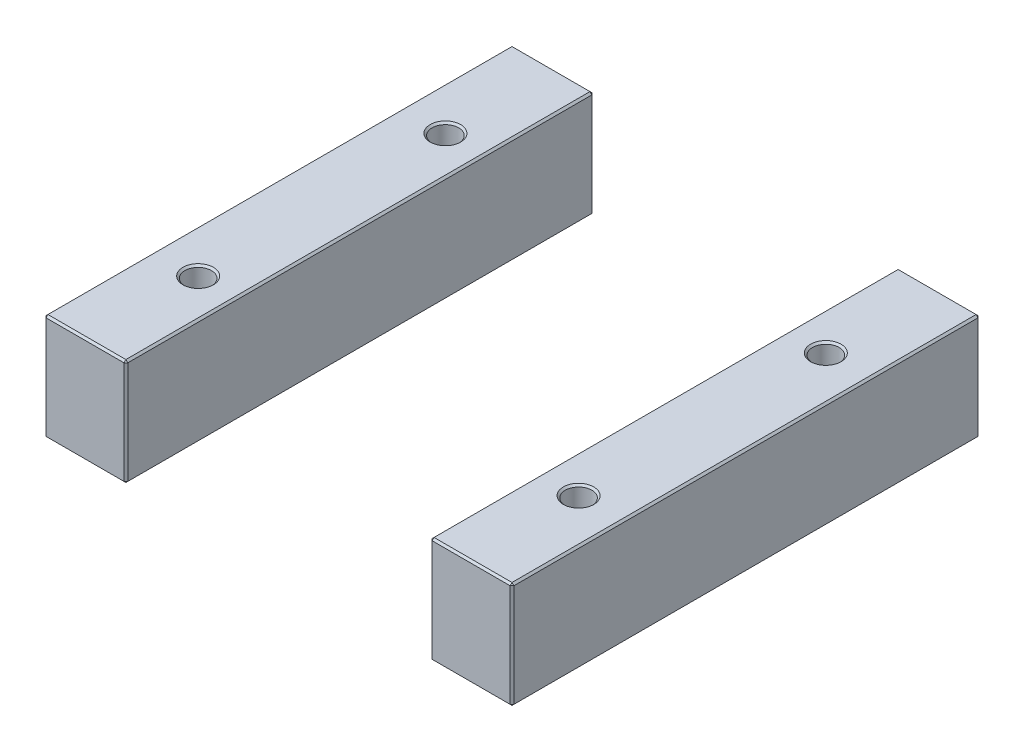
ISO-10303-21;
HEADER;
FILE_DESCRIPTION(('STEP AP214'),'2;1');
FILE_NAME('part.step','',(''),(''),'','','');
FILE_SCHEMA(('AUTOMOTIVE_DESIGN { 1 0 10303 214 1 1 1 1 }'));
ENDSEC;
DATA;
#1=APPLICATION_CONTEXT('core data for automotive mechanical design processes');
#2=APPLICATION_PROTOCOL_DEFINITION('international standard','automotive_design',2000,#1);
#3=PRODUCT_CONTEXT('',#1,'mechanical');
#4=PRODUCT('Part','Part','',(#3));
#5=PRODUCT_RELATED_PRODUCT_CATEGORY('part','',(#4));
#6=PRODUCT_DEFINITION_FORMATION('','',#4);
#7=PRODUCT_DEFINITION_CONTEXT('part definition',#1,'design');
#8=PRODUCT_DEFINITION('design','',#6,#7);
#9=PRODUCT_DEFINITION_SHAPE('','',#8);
#10=(LENGTH_UNIT() NAMED_UNIT(*) SI_UNIT(.MILLI.,.METRE.));
#11=(NAMED_UNIT(*) PLANE_ANGLE_UNIT() SI_UNIT($,.RADIAN.));
#12=(NAMED_UNIT(*) SI_UNIT($,.STERADIAN.) SOLID_ANGLE_UNIT());
#13=UNCERTAINTY_MEASURE_WITH_UNIT(LENGTH_MEASURE(1.E-05),#10,'distance_accuracy_value','');
#14=(GEOMETRIC_REPRESENTATION_CONTEXT(3) GLOBAL_UNCERTAINTY_ASSIGNED_CONTEXT((#13)) GLOBAL_UNIT_ASSIGNED_CONTEXT((#10,
#11,#12)) REPRESENTATION_CONTEXT('',''));
#15=CARTESIAN_POINT('',(0.,0.,0.));
#16=DIRECTION('',(0.,0.,1.));
#17=DIRECTION('',(1.,0.,0.));
#18=AXIS2_PLACEMENT_3D('',#15,#16,#17);
#19=CARTESIAN_POINT('',(-123.,56.,-123.));
#20=DIRECTION('',(0.,0.,1.));
#21=DIRECTION('',(1.,0.,0.));
#22=AXIS2_PLACEMENT_3D('',#19,#20,#21);
#23=PLANE('',#22);
#24=DIRECTION('',(-1.,0.,0.));
#25=VECTOR('',#24,1.);
#26=CARTESIAN_POINT('',(-123.,1.,-123.));
#27=LINE('',#26,#25);
#28=CARTESIAN_POINT('',(-81.,1.,-123.));
#29=VERTEX_POINT('',#28);
#30=CARTESIAN_POINT('',(-122.,1.,-123.));
#31=VERTEX_POINT('',#30);
#32=EDGE_CURVE('P0_E137',#29,#31,#27,.T.);
#33=ORIENTED_EDGE('',*,*,#32,.T.);
#34=DIRECTION('',(0.,1.,0.));
#35=VECTOR('',#34,1.);
#36=CARTESIAN_POINT('',(-122.,56.,-123.));
#37=LINE('',#36,#35);
#38=CARTESIAN_POINT('',(-122.,55.,-123.));
#39=VERTEX_POINT('',#38);
#40=EDGE_CURVE('P0_E235',#31,#39,#37,.T.);
#41=ORIENTED_EDGE('',*,*,#40,.T.);
#42=DIRECTION('',(1.,0.,0.));
#43=VECTOR('',#42,1.);
#44=CARTESIAN_POINT('',(-123.,55.,-123.));
#45=LINE('',#44,#43);
#46=CARTESIAN_POINT('',(-81.,55.,-123.));
#47=VERTEX_POINT('',#46);
#48=EDGE_CURVE('P0_E233',#39,#47,#45,.T.);
#49=ORIENTED_EDGE('',*,*,#48,.T.);
#50=DIRECTION('',(0.,-1.,0.));
#51=VECTOR('',#50,1.);
#52=CARTESIAN_POINT('',(-81.,56.,-123.));
#53=LINE('',#52,#51);
#54=EDGE_CURVE('P0_E230',#47,#29,#53,.T.);
#55=ORIENTED_EDGE('',*,*,#54,.T.);
#56=EDGE_LOOP('',(#33,#41,#49,#55));
#57=FACE_BOUND('',#56,.T.);
#58=ADVANCED_FACE('P0_F16',(#57),#23,.F.);
#59=CARTESIAN_POINT('',(-123.,56.,123.));
#60=DIRECTION('',(1.,0.,0.));
#61=DIRECTION('',(0.,0.,-1.));
#62=AXIS2_PLACEMENT_3D('',#59,#60,#61);
#63=PLANE('',#62);
#64=DIRECTION('',(0.,1.,0.));
#65=VECTOR('',#64,1.);
#66=CARTESIAN_POINT('',(-123.,56.,122.));
#67=LINE('',#66,#65);
#68=CARTESIAN_POINT('',(-123.,1.,122.));
#69=VERTEX_POINT('',#68);
#70=CARTESIAN_POINT('',(-123.,55.,122.));
#71=VERTEX_POINT('',#70);
#72=EDGE_CURVE('P0_E217',#69,#71,#67,.T.);
#73=ORIENTED_EDGE('',*,*,#72,.T.);
#74=DIRECTION('',(0.,0.,-1.));
#75=VECTOR('',#74,1.);
#76=CARTESIAN_POINT('',(-123.,55.,123.));
#77=LINE('',#76,#75);
#78=CARTESIAN_POINT('',(-123.,55.,-122.));
#79=VERTEX_POINT('',#78);
#80=EDGE_CURVE('P0_E228',#71,#79,#77,.T.);
#81=ORIENTED_EDGE('',*,*,#80,.T.);
#82=DIRECTION('',(0.,-1.,0.));
#83=VECTOR('',#82,1.);
#84=CARTESIAN_POINT('',(-123.,56.,-122.));
#85=LINE('',#84,#83);
#86=CARTESIAN_POINT('',(-123.,1.,-122.));
#87=VERTEX_POINT('',#86);
#88=EDGE_CURVE('P0_E225',#79,#87,#85,.T.);
#89=ORIENTED_EDGE('',*,*,#88,.T.);
#90=DIRECTION('',(0.,0.,1.));
#91=VECTOR('',#90,1.);
#92=CARTESIAN_POINT('',(-123.,1.,123.));
#93=LINE('',#92,#91);
#94=EDGE_CURVE('P0_E214',#87,#69,#93,.T.);
#95=ORIENTED_EDGE('',*,*,#94,.T.);
#96=EDGE_LOOP('',(#73,#81,#89,#95));
#97=FACE_BOUND('',#96,.T.);
#98=ADVANCED_FACE('P0_F302',(#97),#63,.F.);
#99=CARTESIAN_POINT('',(-123.,56.,123.));
#100=DIRECTION('',(0.,0.,-1.));
#101=DIRECTION('',(-1.,0.,0.));
#102=AXIS2_PLACEMENT_3D('',#99,#100,#101);
#103=PLANE('',#102);
#104=DIRECTION('',(-1.,0.,0.));
#105=VECTOR('',#104,1.);
#106=CARTESIAN_POINT('',(-123.,55.,123.));
#107=LINE('',#106,#105);
#108=CARTESIAN_POINT('',(-81.,55.,123.));
#109=VERTEX_POINT('',#108);
#110=CARTESIAN_POINT('',(-122.,55.,123.));
#111=VERTEX_POINT('',#110);
#112=EDGE_CURVE('P0_E242',#109,#111,#107,.T.);
#113=ORIENTED_EDGE('',*,*,#112,.T.);
#114=DIRECTION('',(0.,-1.,0.));
#115=VECTOR('',#114,1.);
#116=CARTESIAN_POINT('',(-122.,56.,123.));
#117=LINE('',#116,#115);
#118=CARTESIAN_POINT('',(-122.,1.,123.));
#119=VERTEX_POINT('',#118);
#120=EDGE_CURVE('P0_E244',#111,#119,#117,.T.);
#121=ORIENTED_EDGE('',*,*,#120,.T.);
#122=DIRECTION('',(1.,0.,0.));
#123=VECTOR('',#122,1.);
#124=CARTESIAN_POINT('',(-80.,1.,123.));
#125=LINE('',#124,#123);
#126=CARTESIAN_POINT('',(-81.,1.,123.));
#127=VERTEX_POINT('',#126);
#128=EDGE_CURVE('P0_E240',#119,#127,#125,.T.);
#129=ORIENTED_EDGE('',*,*,#128,.T.);
#130=DIRECTION('',(0.,1.,0.));
#131=VECTOR('',#130,1.);
#132=CARTESIAN_POINT('',(-81.,56.,123.));
#133=LINE('',#132,#131);
#134=EDGE_CURVE('P0_E238',#127,#109,#133,.T.);
#135=ORIENTED_EDGE('',*,*,#134,.T.);
#136=EDGE_LOOP('',(#113,#121,#129,#135));
#137=FACE_BOUND('',#136,.T.);
#138=ADVANCED_FACE('P0_F341',(#137),#103,.F.);
#139=CARTESIAN_POINT('',(-80.,56.,-123.));
#140=DIRECTION('',(-1.,0.,0.));
#141=DIRECTION('',(0.,0.,1.));
#142=AXIS2_PLACEMENT_3D('',#139,#140,#141);
#143=PLANE('',#142);
#144=DIRECTION('',(0.,0.,1.));
#145=VECTOR('',#144,1.);
#146=CARTESIAN_POINT('',(-80.,55.,-123.));
#147=LINE('',#146,#145);
#148=CARTESIAN_POINT('',(-80.,55.,-122.));
#149=VERTEX_POINT('',#148);
#150=CARTESIAN_POINT('',(-80.,55.,122.));
#151=VERTEX_POINT('',#150);
#152=EDGE_CURVE('P0_E31',#149,#151,#147,.T.);
#153=ORIENTED_EDGE('',*,*,#152,.T.);
#154=DIRECTION('',(0.,-1.,0.));
#155=VECTOR('',#154,1.);
#156=CARTESIAN_POINT('',(-80.,56.,122.));
#157=LINE('',#156,#155);
#158=CARTESIAN_POINT('',(-80.,1.,122.));
#159=VERTEX_POINT('',#158);
#160=EDGE_CURVE('P0_E190',#151,#159,#157,.T.);
#161=ORIENTED_EDGE('',*,*,#160,.T.);
#162=DIRECTION('',(0.,0.,-1.));
#163=VECTOR('',#162,1.);
#164=CARTESIAN_POINT('',(-80.,1.,-123.));
#165=LINE('',#164,#163);
#166=CARTESIAN_POINT('',(-80.,1.,-122.));
#167=VERTEX_POINT('',#166);
#168=EDGE_CURVE('P0_E256',#159,#167,#165,.T.);
#169=ORIENTED_EDGE('',*,*,#168,.T.);
#170=DIRECTION('',(0.,1.,0.));
#171=VECTOR('',#170,1.);
#172=CARTESIAN_POINT('',(-80.,56.,-122.));
#173=LINE('',#172,#171);
#174=EDGE_CURVE('P0_E36',#167,#149,#173,.T.);
#175=ORIENTED_EDGE('',*,*,#174,.T.);
#176=EDGE_LOOP('',(#153,#161,#169,#175));
#177=FACE_BOUND('',#176,.T.);
#178=ADVANCED_FACE('P0_F535',(#177),#143,.F.);
#179=CARTESIAN_POINT('',(0.,56.,0.));
#180=DIRECTION('',(0.,-1.,0.));
#181=DIRECTION('',(0.,0.,-1.));
#182=AXIS2_PLACEMENT_3D('',#179,#180,#181);
#183=PLANE('',#182);
#184=CARTESIAN_POINT('',(-100.,56.,65.));
#185=DIRECTION('',(0.,-1.,0.));
#186=DIRECTION('',(0.,0.,-1.));
#187=AXIS2_PLACEMENT_3D('',#184,#185,#186);
#188=CIRCLE('',#187,8.);
#189=CARTESIAN_POINT('',(-100.,56.,57.));
#190=VERTEX_POINT('',#189);
#191=EDGE_CURVE('P0_E24',#190,#190,#188,.T.);
#192=ORIENTED_EDGE('',*,*,#191,.T.);
#193=EDGE_LOOP('',(#192));
#194=FACE_BOUND('',#193,.T.);
#195=CARTESIAN_POINT('',(-100.,56.,-65.));
#196=DIRECTION('',(0.,-1.,0.));
#197=DIRECTION('',(0.,0.,-1.));
#198=AXIS2_PLACEMENT_3D('',#195,#196,#197);
#199=CIRCLE('',#198,8.);
#200=CARTESIAN_POINT('',(-100.,56.,-73.));
#201=VERTEX_POINT('',#200);
#202=EDGE_CURVE('P0_E189',#201,#201,#199,.T.);
#203=ORIENTED_EDGE('',*,*,#202,.T.);
#204=EDGE_LOOP('',(#203));
#205=FACE_BOUND('',#204,.T.);
#206=DIRECTION('',(0.,0.,1.));
#207=VECTOR('',#206,1.);
#208=CARTESIAN_POINT('',(-122.,56.,0.));
#209=LINE('',#208,#207);
#210=CARTESIAN_POINT('',(-122.,56.,-122.));
#211=VERTEX_POINT('',#210);
#212=CARTESIAN_POINT('',(-122.,56.,122.));
#213=VERTEX_POINT('',#212);
#214=EDGE_CURVE('P0_E251',#211,#213,#209,.T.);
#215=ORIENTED_EDGE('',*,*,#214,.T.);
#216=DIRECTION('',(1.,0.,0.));
#217=VECTOR('',#216,1.);
#218=CARTESIAN_POINT('',(0.,56.,122.));
#219=LINE('',#218,#217);
#220=CARTESIAN_POINT('',(-81.,56.,122.));
#221=VERTEX_POINT('',#220);
#222=EDGE_CURVE('P0_E253',#213,#221,#219,.T.);
#223=ORIENTED_EDGE('',*,*,#222,.T.);
#224=DIRECTION('',(0.,0.,-1.));
#225=VECTOR('',#224,1.);
#226=CARTESIAN_POINT('',(-81.,56.,0.));
#227=LINE('',#226,#225);
#228=CARTESIAN_POINT('',(-81.,56.,-122.));
#229=VERTEX_POINT('',#228);
#230=EDGE_CURVE('P0_E247',#221,#229,#227,.T.);
#231=ORIENTED_EDGE('',*,*,#230,.T.);
#232=DIRECTION('',(-1.,0.,0.));
#233=VECTOR('',#232,1.);
#234=CARTESIAN_POINT('',(0.,56.,-122.));
#235=LINE('',#234,#233);
#236=EDGE_CURVE('P0_E249',#229,#211,#235,.T.);
#237=ORIENTED_EDGE('',*,*,#236,.T.);
#238=EDGE_LOOP('',(#215,#223,#231,#237));
#239=FACE_BOUND('',#238,.T.);
#240=ADVANCED_FACE('P0_F195',(#194,#205,#239),#183,.F.);
#241=CARTESIAN_POINT('',(0.,0.,0.));
#242=DIRECTION('',(0.,-1.,0.));
#243=DIRECTION('',(0.,0.,-1.));
#244=AXIS2_PLACEMENT_3D('',#241,#242,#243);
#245=PLANE('',#244);
#246=CARTESIAN_POINT('',(-100.,0.,-65.));
#247=DIRECTION('',(0.,-1.,0.));
#248=DIRECTION('',(0.,0.,-1.));
#249=AXIS2_PLACEMENT_3D('',#246,#247,#248);
#250=CIRCLE('',#249,8.);
#251=CARTESIAN_POINT('',(-100.,0.,-73.));
#252=VERTEX_POINT('',#251);
#253=EDGE_CURVE('P0_E220',#252,#252,#250,.F.);
#254=ORIENTED_EDGE('',*,*,#253,.T.);
#255=EDGE_LOOP('',(#254));
#256=FACE_BOUND('',#255,.T.);
#257=CARTESIAN_POINT('',(-100.,0.,65.));
#258=DIRECTION('',(0.,-1.,0.));
#259=DIRECTION('',(0.,0.,-1.));
#260=AXIS2_PLACEMENT_3D('',#257,#258,#259);
#261=CIRCLE('',#260,8.);
#262=CARTESIAN_POINT('',(-100.,0.,57.));
#263=VERTEX_POINT('',#262);
#264=EDGE_CURVE('P0_E608',#263,#263,#261,.F.);
#265=ORIENTED_EDGE('',*,*,#264,.T.);
#266=EDGE_LOOP('',(#265));
#267=FACE_BOUND('',#266,.T.);
#268=DIRECTION('',(-1.,0.,0.));
#269=VECTOR('',#268,1.);
#270=CARTESIAN_POINT('',(-123.,0.,122.));
#271=LINE('',#270,#269);
#272=CARTESIAN_POINT('',(-81.,0.,122.));
#273=VERTEX_POINT('',#272);
#274=CARTESIAN_POINT('',(-122.,0.,122.));
#275=VERTEX_POINT('',#274);
#276=EDGE_CURVE('P0_E114',#273,#275,#271,.T.);
#277=ORIENTED_EDGE('',*,*,#276,.T.);
#278=DIRECTION('',(0.,0.,-1.));
#279=VECTOR('',#278,1.);
#280=CARTESIAN_POINT('',(-122.,0.,-123.));
#281=LINE('',#280,#279);
#282=CARTESIAN_POINT('',(-122.,0.,-122.));
#283=VERTEX_POINT('',#282);
#284=EDGE_CURVE('P0_E110',#275,#283,#281,.T.);
#285=ORIENTED_EDGE('',*,*,#284,.T.);
#286=DIRECTION('',(1.,0.,0.));
#287=VECTOR('',#286,1.);
#288=CARTESIAN_POINT('',(-80.,0.,-122.));
#289=LINE('',#288,#287);
#290=CARTESIAN_POINT('',(-81.,0.,-122.));
#291=VERTEX_POINT('',#290);
#292=EDGE_CURVE('P0_E104',#283,#291,#289,.T.);
#293=ORIENTED_EDGE('',*,*,#292,.T.);
#294=DIRECTION('',(0.,0.,1.));
#295=VECTOR('',#294,1.);
#296=CARTESIAN_POINT('',(-81.,0.,123.));
#297=LINE('',#296,#295);
#298=EDGE_CURVE('P0_E107',#291,#273,#297,.T.);
#299=ORIENTED_EDGE('',*,*,#298,.T.);
#300=EDGE_LOOP('',(#277,#285,#293,#299));
#301=FACE_BOUND('',#300,.T.);
#302=ADVANCED_FACE('P0_F106',(#256,#267,#301),#245,.T.);
#303=CARTESIAN_POINT('',(-100.,0.,-65.));
#304=DIRECTION('',(0.,1.,0.));
#305=DIRECTION('',(0.,0.,1.));
#306=AXIS2_PLACEMENT_3D('',#303,#304,#305);
#307=CYLINDRICAL_SURFACE('',#306,7.);
#308=CARTESIAN_POINT('',(-100.,55.,-65.));
#309=DIRECTION('',(0.,-1.,0.));
#310=DIRECTION('',(0.,0.,-1.));
#311=AXIS2_PLACEMENT_3D('',#308,#309,#310);
#312=CIRCLE('',#311,7.);
#313=CARTESIAN_POINT('',(-100.,55.,-72.));
#314=VERTEX_POINT('',#313);
#315=EDGE_CURVE('P0_E10',#314,#314,#312,.F.);
#316=ORIENTED_EDGE('',*,*,#315,.T.);
#317=EDGE_LOOP('',(#316));
#318=FACE_BOUND('',#317,.T.);
#319=CARTESIAN_POINT('',(-100.,0.999999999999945,-65.));
#320=DIRECTION('',(0.,-1.,0.));
#321=DIRECTION('',(0.,0.,-1.));
#322=AXIS2_PLACEMENT_3D('',#319,#320,#321);
#323=CIRCLE('',#322,7.);
#324=CARTESIAN_POINT('',(-100.,0.999999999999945,-72.));
#325=VERTEX_POINT('',#324);
#326=EDGE_CURVE('P0_E215',#325,#325,#323,.T.);
#327=ORIENTED_EDGE('',*,*,#326,.T.);
#328=EDGE_LOOP('',(#327));
#329=FACE_BOUND('',#328,.T.);
#330=ADVANCED_FACE('P0_F208',(#318,#329),#307,.F.);
#331=CARTESIAN_POINT('',(-100.,0.,65.));
#332=DIRECTION('',(0.,1.,0.));
#333=DIRECTION('',(0.,0.,1.));
#334=AXIS2_PLACEMENT_3D('',#331,#332,#333);
#335=CYLINDRICAL_SURFACE('',#334,7.);
#336=CARTESIAN_POINT('',(-100.,55.,65.));
#337=DIRECTION('',(0.,-1.,0.));
#338=DIRECTION('',(0.,0.,-1.));
#339=AXIS2_PLACEMENT_3D('',#336,#337,#338);
#340=CIRCLE('',#339,7.);
#341=CARTESIAN_POINT('',(-100.,55.,58.));
#342=VERTEX_POINT('',#341);
#343=EDGE_CURVE('P0_E186',#342,#342,#340,.F.);
#344=ORIENTED_EDGE('',*,*,#343,.T.);
#345=EDGE_LOOP('',(#344));
#346=FACE_BOUND('',#345,.T.);
#347=CARTESIAN_POINT('',(-100.,1.00000000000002,65.));
#348=DIRECTION('',(0.,-1.,0.));
#349=DIRECTION('',(0.,0.,-1.));
#350=AXIS2_PLACEMENT_3D('',#347,#348,#349);
#351=CIRCLE('',#350,7.);
#352=CARTESIAN_POINT('',(-100.,1.00000000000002,58.));
#353=VERTEX_POINT('',#352);
#354=EDGE_CURVE('P0_E212',#353,#353,#351,.T.);
#355=ORIENTED_EDGE('',*,*,#354,.T.);
#356=EDGE_LOOP('',(#355));
#357=FACE_BOUND('',#356,.T.);
#358=ADVANCED_FACE('P0_F204',(#346,#357),#335,.F.);
#359=CARTESIAN_POINT('',(-100.,0.,-65.));
#360=DIRECTION('',(0.,-1.,0.));
#361=DIRECTION('',(0.,0.,-1.));
#362=AXIS2_PLACEMENT_3D('',#359,#360,#361);
#363=CONICAL_SURFACE('',#362,8.,0.785398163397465);
#364=ORIENTED_EDGE('',*,*,#326,.F.);
#365=EDGE_LOOP('',(#364));
#366=FACE_BOUND('',#365,.T.);
#367=ORIENTED_EDGE('',*,*,#253,.F.);
#368=EDGE_LOOP('',(#367));
#369=FACE_BOUND('',#368,.T.);
#370=ADVANCED_FACE('P0_F207',(#366,#369),#363,.F.);
#371=CARTESIAN_POINT('',(-100.,0.,65.));
#372=DIRECTION('',(0.,-1.,0.));
#373=DIRECTION('',(0.,0.,-1.));
#374=AXIS2_PLACEMENT_3D('',#371,#372,#373);
#375=CONICAL_SURFACE('',#374,8.,0.785398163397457);
#376=ORIENTED_EDGE('',*,*,#354,.F.);
#377=EDGE_LOOP('',(#376));
#378=FACE_BOUND('',#377,.T.);
#379=ORIENTED_EDGE('',*,*,#264,.F.);
#380=EDGE_LOOP('',(#379));
#381=FACE_BOUND('',#380,.T.);
#382=ADVANCED_FACE('P0_F347',(#378,#381),#375,.F.);
#383=CARTESIAN_POINT('',(-80.,56.,122.));
#384=DIRECTION('',(-0.707106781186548,0.,-0.707106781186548));
#385=DIRECTION('',(0.,-1.,0.));
#386=AXIS2_PLACEMENT_3D('',#383,#384,#385);
#387=PLANE('',#386);
#388=DIRECTION('',(-0.707106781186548,0.,0.707106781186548));
#389=VECTOR('',#388,1.);
#390=CARTESIAN_POINT('',(-80.5,55.,122.5));
#391=LINE('',#390,#389);
#392=EDGE_CURVE('P0_E125',#109,#151,#391,.F.);
#393=ORIENTED_EDGE('',*,*,#392,.F.);
#394=ORIENTED_EDGE('',*,*,#134,.F.);
#395=DIRECTION('',(0.707106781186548,0.,-0.707106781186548));
#396=VECTOR('',#395,1.);
#397=CARTESIAN_POINT('',(-81.,1.,123.));
#398=LINE('',#397,#396);
#399=EDGE_CURVE('P0_E181',#159,#127,#398,.F.);
#400=ORIENTED_EDGE('',*,*,#399,.F.);
#401=ORIENTED_EDGE('',*,*,#160,.F.);
#402=EDGE_LOOP('',(#393,#394,#400,#401));
#403=FACE_BOUND('',#402,.T.);
#404=ADVANCED_FACE('P0_F351',(#403),#387,.F.);
#405=CARTESIAN_POINT('',(-81.,56.,122.));
#406=DIRECTION('',(0.577350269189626,0.577350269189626,0.577350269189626));
#407=DIRECTION('',(0.707106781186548,0.,-0.707106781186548));
#408=AXIS2_PLACEMENT_3D('',#405,#406,#407);
#409=PLANE('',#408);
#410=DIRECTION('',(0.,0.707106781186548,-0.707106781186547));
#411=VECTOR('',#410,1.);
#412=CARTESIAN_POINT('',(-81.,56.,122.));
#413=LINE('',#412,#411);
#414=EDGE_CURVE('P0_E175',#109,#221,#413,.T.);
#415=ORIENTED_EDGE('',*,*,#414,.F.);
#416=ORIENTED_EDGE('',*,*,#392,.T.);
#417=DIRECTION('',(0.70710678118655,-0.707106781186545,0.));
#418=VECTOR('',#417,1.);
#419=CARTESIAN_POINT('',(-81.,56.,122.));
#420=LINE('',#419,#418);
#421=EDGE_CURVE('P0_E178',#221,#151,#420,.T.);
#422=ORIENTED_EDGE('',*,*,#421,.F.);
#423=EDGE_LOOP('',(#415,#416,#422));
#424=FACE_BOUND('',#423,.T.);
#425=ADVANCED_FACE('P0_F487',(#424),#409,.T.);
#426=CARTESIAN_POINT('',(-81.,1.,123.));
#427=DIRECTION('',(0.577350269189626,-0.577350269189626,0.577350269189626));
#428=DIRECTION('',(0.707106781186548,0.,-0.707106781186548));
#429=AXIS2_PLACEMENT_3D('',#426,#427,#428);
#430=PLANE('',#429);
#431=DIRECTION('',(0.70710678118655,0.707106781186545,0.));
#432=VECTOR('',#431,1.);
#433=CARTESIAN_POINT('',(-80.5,0.5,122.));
#434=LINE('',#433,#432);
#435=EDGE_CURVE('P0_E123',#159,#273,#434,.F.);
#436=ORIENTED_EDGE('',*,*,#435,.F.);
#437=ORIENTED_EDGE('',*,*,#399,.T.);
#438=DIRECTION('',(0.,-0.707106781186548,-0.707106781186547));
#439=VECTOR('',#438,1.);
#440=CARTESIAN_POINT('',(-81.,1.,123.));
#441=LINE('',#440,#439);
#442=EDGE_CURVE('P0_E172',#273,#127,#441,.F.);
#443=ORIENTED_EDGE('',*,*,#442,.F.);
#444=EDGE_LOOP('',(#436,#437,#443));
#445=FACE_BOUND('',#444,.T.);
#446=ADVANCED_FACE('P0_F478',(#445),#430,.T.);
#447=CARTESIAN_POINT('',(-81.,56.,0.));
#448=DIRECTION('',(-0.707106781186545,-0.70710678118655,0.));
#449=DIRECTION('',(0.,0.,-1.));
#450=AXIS2_PLACEMENT_3D('',#447,#448,#449);
#451=PLANE('',#450);
#452=ORIENTED_EDGE('',*,*,#421,.T.);
#453=ORIENTED_EDGE('',*,*,#152,.F.);
#454=DIRECTION('',(-0.70710678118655,0.707106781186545,0.));
#455=VECTOR('',#454,1.);
#456=CARTESIAN_POINT('',(-80.5,55.5,-122.));
#457=LINE('',#456,#455);
#458=EDGE_CURVE('P0_E165',#229,#149,#457,.F.);
#459=ORIENTED_EDGE('',*,*,#458,.F.);
#460=ORIENTED_EDGE('',*,*,#230,.F.);
#461=EDGE_LOOP('',(#452,#453,#459,#460));
#462=FACE_BOUND('',#461,.T.);
#463=ADVANCED_FACE('P0_F318',(#462),#451,.F.);
#464=CARTESIAN_POINT('',(0.,56.,122.));
#465=DIRECTION('',(0.,-0.707106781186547,-0.707106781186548));
#466=DIRECTION('',(1.,0.,0.));
#467=AXIS2_PLACEMENT_3D('',#464,#465,#466);
#468=PLANE('',#467);
#469=ORIENTED_EDGE('',*,*,#414,.T.);
#470=ORIENTED_EDGE('',*,*,#222,.F.);
#471=DIRECTION('',(0.,-0.707106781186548,0.707106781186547));
#472=VECTOR('',#471,1.);
#473=CARTESIAN_POINT('',(-122.,55.5,122.5));
#474=LINE('',#473,#472);
#475=EDGE_CURVE('P0_E162',#111,#213,#474,.F.);
#476=ORIENTED_EDGE('',*,*,#475,.F.);
#477=ORIENTED_EDGE('',*,*,#112,.F.);
#478=EDGE_LOOP('',(#469,#470,#476,#477));
#479=FACE_BOUND('',#478,.T.);
#480=ADVANCED_FACE('P0_F313',(#479),#468,.F.);
#481=CARTESIAN_POINT('',(-122.,56.,123.));
#482=DIRECTION('',(0.707106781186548,0.,-0.707106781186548));
#483=DIRECTION('',(0.,-1.,0.));
#484=AXIS2_PLACEMENT_3D('',#481,#482,#483);
#485=PLANE('',#484);
#486=DIRECTION('',(0.707106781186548,0.,0.707106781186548));
#487=VECTOR('',#486,1.);
#488=CARTESIAN_POINT('',(-122.,1.,123.));
#489=LINE('',#488,#487);
#490=EDGE_CURVE('P0_E156',#119,#69,#489,.F.);
#491=ORIENTED_EDGE('',*,*,#490,.F.);
#492=ORIENTED_EDGE('',*,*,#120,.F.);
#493=DIRECTION('',(-0.707106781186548,0.,-0.707106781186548));
#494=VECTOR('',#493,1.);
#495=CARTESIAN_POINT('',(-123.,55.,122.));
#496=LINE('',#495,#494);
#497=EDGE_CURVE('P0_E159',#71,#111,#496,.F.);
#498=ORIENTED_EDGE('',*,*,#497,.F.);
#499=ORIENTED_EDGE('',*,*,#72,.F.);
#500=EDGE_LOOP('',(#491,#492,#498,#499));
#501=FACE_BOUND('',#500,.T.);
#502=ADVANCED_FACE('P0_F307',(#501),#485,.F.);
#503=CARTESIAN_POINT('',(-123.,1.,123.));
#504=DIRECTION('',(0.,-0.707106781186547,0.707106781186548));
#505=DIRECTION('',(-1.,0.,0.));
#506=AXIS2_PLACEMENT_3D('',#503,#504,#505);
#507=PLANE('',#506);
#508=ORIENTED_EDGE('',*,*,#442,.T.);
#509=ORIENTED_EDGE('',*,*,#128,.F.);
#510=DIRECTION('',(0.,0.707106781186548,0.707106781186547));
#511=VECTOR('',#510,1.);
#512=CARTESIAN_POINT('',(-122.,1.,123.));
#513=LINE('',#512,#511);
#514=EDGE_CURVE('P0_E134',#275,#119,#513,.T.);
#515=ORIENTED_EDGE('',*,*,#514,.F.);
#516=ORIENTED_EDGE('',*,*,#276,.F.);
#517=EDGE_LOOP('',(#508,#509,#515,#516));
#518=FACE_BOUND('',#517,.T.);
#519=ADVANCED_FACE('P0_F333',(#518),#507,.T.);
#520=CARTESIAN_POINT('',(-80.,1.,-123.));
#521=DIRECTION('',(0.707106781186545,-0.70710678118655,0.));
#522=DIRECTION('',(0.,0.,1.));
#523=AXIS2_PLACEMENT_3D('',#520,#521,#522);
#524=PLANE('',#523);
#525=ORIENTED_EDGE('',*,*,#435,.T.);
#526=ORIENTED_EDGE('',*,*,#298,.F.);
#527=DIRECTION('',(-0.70710678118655,-0.707106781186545,0.));
#528=VECTOR('',#527,1.);
#529=CARTESIAN_POINT('',(-81.,0.,-122.));
#530=LINE('',#529,#528);
#531=EDGE_CURVE('P0_E120',#167,#291,#530,.T.);
#532=ORIENTED_EDGE('',*,*,#531,.F.);
#533=ORIENTED_EDGE('',*,*,#168,.F.);
#534=EDGE_LOOP('',(#525,#526,#532,#533));
#535=FACE_BOUND('',#534,.T.);
#536=ADVANCED_FACE('P0_F119',(#535),#524,.T.);
#537=CARTESIAN_POINT('',(-81.,56.,-123.));
#538=DIRECTION('',(-0.707106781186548,0.,0.707106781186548));
#539=DIRECTION('',(0.,-1.,0.));
#540=AXIS2_PLACEMENT_3D('',#537,#538,#539);
#541=PLANE('',#540);
#542=DIRECTION('',(0.707106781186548,0.,0.707106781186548));
#543=VECTOR('',#542,1.);
#544=CARTESIAN_POINT('',(-81.,55.,-123.));
#545=LINE('',#544,#543);
#546=EDGE_CURVE('P0_E168',#149,#47,#545,.F.);
#547=ORIENTED_EDGE('',*,*,#546,.F.);
#548=ORIENTED_EDGE('',*,*,#174,.F.);
#549=DIRECTION('',(-0.707106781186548,0.,-0.707106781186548));
#550=VECTOR('',#549,1.);
#551=CARTESIAN_POINT('',(-80.5,1.,-122.5));
#552=LINE('',#551,#550);
#553=EDGE_CURVE('P0_E133',#29,#167,#552,.F.);
#554=ORIENTED_EDGE('',*,*,#553,.F.);
#555=ORIENTED_EDGE('',*,*,#54,.F.);
#556=EDGE_LOOP('',(#547,#548,#554,#555));
#557=FACE_BOUND('',#556,.T.);
#558=ADVANCED_FACE('P0_F323',(#557),#541,.F.);
#559=CARTESIAN_POINT('',(-81.,55.,-123.));
#560=DIRECTION('',(0.577350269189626,0.577350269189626,-0.577350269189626));
#561=DIRECTION('',(-0.707106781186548,0.,-0.707106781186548));
#562=AXIS2_PLACEMENT_3D('',#559,#560,#561);
#563=PLANE('',#562);
#564=ORIENTED_EDGE('',*,*,#458,.T.);
#565=ORIENTED_EDGE('',*,*,#546,.T.);
#566=DIRECTION('',(0.,-0.707106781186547,-0.707106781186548));
#567=VECTOR('',#566,1.);
#568=CARTESIAN_POINT('',(-81.,55.,-123.));
#569=LINE('',#568,#567);
#570=EDGE_CURVE('P0_E151',#229,#47,#569,.T.);
#571=ORIENTED_EDGE('',*,*,#570,.F.);
#572=EDGE_LOOP('',(#564,#565,#571));
#573=FACE_BOUND('',#572,.T.);
#574=ADVANCED_FACE('P0_F321',(#573),#563,.T.);
#575=CARTESIAN_POINT('',(-123.,55.,122.));
#576=DIRECTION('',(-0.577350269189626,0.577350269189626,0.577350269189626));
#577=DIRECTION('',(0.707106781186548,0.,0.707106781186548));
#578=AXIS2_PLACEMENT_3D('',#575,#576,#577);
#579=PLANE('',#578);
#580=ORIENTED_EDGE('',*,*,#497,.T.);
#581=ORIENTED_EDGE('',*,*,#475,.T.);
#582=DIRECTION('',(0.707106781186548,0.707106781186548,0.));
#583=VECTOR('',#582,1.);
#584=CARTESIAN_POINT('',(-123.,55.,122.));
#585=LINE('',#584,#583);
#586=EDGE_CURVE('P0_E142',#71,#213,#585,.T.);
#587=ORIENTED_EDGE('',*,*,#586,.F.);
#588=EDGE_LOOP('',(#580,#581,#587));
#589=FACE_BOUND('',#588,.T.);
#590=ADVANCED_FACE('P0_F310',(#589),#579,.T.);
#591=CARTESIAN_POINT('',(-122.,1.,123.));
#592=DIRECTION('',(-0.577350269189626,-0.577350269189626,0.577350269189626));
#593=DIRECTION('',(0.707106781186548,0.,0.707106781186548));
#594=AXIS2_PLACEMENT_3D('',#591,#592,#593);
#595=PLANE('',#594);
#596=ORIENTED_EDGE('',*,*,#514,.T.);
#597=ORIENTED_EDGE('',*,*,#490,.T.);
#598=DIRECTION('',(0.707106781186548,-0.707106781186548,0.));
#599=VECTOR('',#598,1.);
#600=CARTESIAN_POINT('',(-122.5,0.5,122.));
#601=LINE('',#600,#599);
#602=EDGE_CURVE('P0_E138',#275,#69,#601,.F.);
#603=ORIENTED_EDGE('',*,*,#602,.F.);
#604=EDGE_LOOP('',(#596,#597,#603));
#605=FACE_BOUND('',#604,.T.);
#606=ADVANCED_FACE('P0_F368',(#605),#595,.T.);
#607=CARTESIAN_POINT('',(-81.,0.,-122.));
#608=DIRECTION('',(0.577350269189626,-0.577350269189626,-0.577350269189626));
#609=DIRECTION('',(-0.707106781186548,0.,-0.707106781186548));
#610=AXIS2_PLACEMENT_3D('',#607,#608,#609);
#611=PLANE('',#610);
#612=ORIENTED_EDGE('',*,*,#553,.T.);
#613=ORIENTED_EDGE('',*,*,#531,.T.);
#614=DIRECTION('',(0.,0.707106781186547,-0.707106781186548));
#615=VECTOR('',#614,1.);
#616=CARTESIAN_POINT('',(-81.,0.,-122.));
#617=LINE('',#616,#615);
#618=EDGE_CURVE('P0_E130',#29,#291,#617,.F.);
#619=ORIENTED_EDGE('',*,*,#618,.F.);
#620=EDGE_LOOP('',(#612,#613,#619));
#621=FACE_BOUND('',#620,.T.);
#622=ADVANCED_FACE('P0_F129',(#621),#611,.T.);
#623=CARTESIAN_POINT('',(0.,56.,-122.));
#624=DIRECTION('',(0.,-0.707106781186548,0.707106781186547));
#625=DIRECTION('',(-1.,0.,0.));
#626=AXIS2_PLACEMENT_3D('',#623,#624,#625);
#627=PLANE('',#626);
#628=ORIENTED_EDGE('',*,*,#570,.T.);
#629=ORIENTED_EDGE('',*,*,#48,.F.);
#630=DIRECTION('',(0.,0.707106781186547,0.707106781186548));
#631=VECTOR('',#630,1.);
#632=CARTESIAN_POINT('',(-122.,55.,-123.));
#633=LINE('',#632,#631);
#634=EDGE_CURVE('P0_E139',#211,#39,#633,.F.);
#635=ORIENTED_EDGE('',*,*,#634,.F.);
#636=ORIENTED_EDGE('',*,*,#236,.F.);
#637=EDGE_LOOP('',(#628,#629,#635,#636));
#638=FACE_BOUND('',#637,.T.);
#639=ADVANCED_FACE('P0_F286',(#638),#627,.F.);
#640=CARTESIAN_POINT('',(-122.,56.,0.));
#641=DIRECTION('',(0.707106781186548,-0.707106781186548,0.));
#642=DIRECTION('',(0.,0.,1.));
#643=AXIS2_PLACEMENT_3D('',#640,#641,#642);
#644=PLANE('',#643);
#645=ORIENTED_EDGE('',*,*,#586,.T.);
#646=ORIENTED_EDGE('',*,*,#214,.F.);
#647=DIRECTION('',(-0.707106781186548,-0.707106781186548,0.));
#648=VECTOR('',#647,1.);
#649=CARTESIAN_POINT('',(-122.5,55.5,-122.));
#650=LINE('',#649,#648);
#651=EDGE_CURVE('P0_E145',#79,#211,#650,.F.);
#652=ORIENTED_EDGE('',*,*,#651,.F.);
#653=ORIENTED_EDGE('',*,*,#80,.F.);
#654=EDGE_LOOP('',(#645,#646,#652,#653));
#655=FACE_BOUND('',#654,.T.);
#656=ADVANCED_FACE('P0_F280',(#655),#644,.F.);
#657=CARTESIAN_POINT('',(-123.,1.,123.));
#658=DIRECTION('',(-0.707106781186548,-0.707106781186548,0.));
#659=DIRECTION('',(0.,0.,-1.));
#660=AXIS2_PLACEMENT_3D('',#657,#658,#659);
#661=PLANE('',#660);
#662=ORIENTED_EDGE('',*,*,#602,.T.);
#663=ORIENTED_EDGE('',*,*,#94,.F.);
#664=DIRECTION('',(-0.707106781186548,0.707106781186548,0.));
#665=VECTOR('',#664,1.);
#666=CARTESIAN_POINT('',(-123.,1.,-122.));
#667=LINE('',#666,#665);
#668=EDGE_CURVE('P0_E267',#283,#87,#667,.T.);
#669=ORIENTED_EDGE('',*,*,#668,.F.);
#670=ORIENTED_EDGE('',*,*,#284,.F.);
#671=EDGE_LOOP('',(#662,#663,#669,#670));
#672=FACE_BOUND('',#671,.T.);
#673=ADVANCED_FACE('P0_F298',(#672),#661,.T.);
#674=CARTESIAN_POINT('',(-123.,1.,-123.));
#675=DIRECTION('',(0.,-0.707106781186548,-0.707106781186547));
#676=DIRECTION('',(1.,0.,0.));
#677=AXIS2_PLACEMENT_3D('',#674,#675,#676);
#678=PLANE('',#677);
#679=ORIENTED_EDGE('',*,*,#618,.T.);
#680=ORIENTED_EDGE('',*,*,#292,.F.);
#681=DIRECTION('',(0.,-0.707106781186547,0.707106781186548));
#682=VECTOR('',#681,1.);
#683=CARTESIAN_POINT('',(-122.,0.5,-122.5));
#684=LINE('',#683,#682);
#685=EDGE_CURVE('P0_E265',#31,#283,#684,.T.);
#686=ORIENTED_EDGE('',*,*,#685,.F.);
#687=ORIENTED_EDGE('',*,*,#32,.F.);
#688=EDGE_LOOP('',(#679,#680,#686,#687));
#689=FACE_BOUND('',#688,.T.);
#690=ADVANCED_FACE('P0_F136',(#689),#678,.T.);
#691=CARTESIAN_POINT('',(-122.,55.,-123.));
#692=DIRECTION('',(-0.577350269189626,0.577350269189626,-0.577350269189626));
#693=DIRECTION('',(-0.707106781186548,0.,0.707106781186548));
#694=AXIS2_PLACEMENT_3D('',#691,#692,#693);
#695=PLANE('',#694);
#696=ORIENTED_EDGE('',*,*,#651,.T.);
#697=ORIENTED_EDGE('',*,*,#634,.T.);
#698=DIRECTION('',(0.707106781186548,0.,-0.707106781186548));
#699=VECTOR('',#698,1.);
#700=CARTESIAN_POINT('',(-122.,55.,-123.));
#701=LINE('',#700,#699);
#702=EDGE_CURVE('P0_E263',#79,#39,#701,.T.);
#703=ORIENTED_EDGE('',*,*,#702,.F.);
#704=EDGE_LOOP('',(#696,#697,#703));
#705=FACE_BOUND('',#704,.T.);
#706=ADVANCED_FACE('P0_F273',(#705),#695,.T.);
#707=CARTESIAN_POINT('',(-123.,1.,-122.));
#708=DIRECTION('',(-0.577350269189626,-0.577350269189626,-0.577350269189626));
#709=DIRECTION('',(-0.707106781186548,0.,0.707106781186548));
#710=AXIS2_PLACEMENT_3D('',#707,#708,#709);
#711=PLANE('',#710);
#712=ORIENTED_EDGE('',*,*,#685,.T.);
#713=ORIENTED_EDGE('',*,*,#668,.T.);
#714=DIRECTION('',(-0.707106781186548,0.,0.707106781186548));
#715=VECTOR('',#714,1.);
#716=CARTESIAN_POINT('',(-123.,1.,-122.));
#717=LINE('',#716,#715);
#718=EDGE_CURVE('P0_E261',#31,#87,#717,.T.);
#719=ORIENTED_EDGE('',*,*,#718,.F.);
#720=EDGE_LOOP('',(#712,#713,#719));
#721=FACE_BOUND('',#720,.T.);
#722=ADVANCED_FACE('P0_F294',(#721),#711,.T.);
#723=CARTESIAN_POINT('',(-123.,56.,-122.));
#724=DIRECTION('',(0.707106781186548,0.,0.707106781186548));
#725=DIRECTION('',(0.,-1.,0.));
#726=AXIS2_PLACEMENT_3D('',#723,#724,#725);
#727=PLANE('',#726);
#728=ORIENTED_EDGE('',*,*,#702,.T.);
#729=ORIENTED_EDGE('',*,*,#40,.F.);
#730=ORIENTED_EDGE('',*,*,#718,.T.);
#731=ORIENTED_EDGE('',*,*,#88,.F.);
#732=EDGE_LOOP('',(#728,#729,#730,#731));
#733=FACE_BOUND('',#732,.T.);
#734=ADVANCED_FACE('P0_F201',(#733),#727,.F.);
#735=CARTESIAN_POINT('',(-100.,55.,65.));
#736=DIRECTION('',(0.,1.,0.));
#737=DIRECTION('',(0.,0.,1.));
#738=AXIS2_PLACEMENT_3D('',#735,#736,#737);
#739=CONICAL_SURFACE('',#738,7.,0.785398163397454);
#740=ORIENTED_EDGE('',*,*,#191,.F.);
#741=EDGE_LOOP('',(#740));
#742=FACE_BOUND('',#741,.T.);
#743=ORIENTED_EDGE('',*,*,#343,.F.);
#744=EDGE_LOOP('',(#743));
#745=FACE_BOUND('',#744,.T.);
#746=ADVANCED_FACE('P0_F198',(#742,#745),#739,.F.);
#747=CARTESIAN_POINT('',(-100.,55.,-65.));
#748=DIRECTION('',(0.,1.,0.));
#749=DIRECTION('',(0.,0.,1.));
#750=AXIS2_PLACEMENT_3D('',#747,#748,#749);
#751=CONICAL_SURFACE('',#750,7.,0.785398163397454);
#752=ORIENTED_EDGE('',*,*,#202,.F.);
#753=EDGE_LOOP('',(#752));
#754=FACE_BOUND('',#753,.T.);
#755=ORIENTED_EDGE('',*,*,#315,.F.);
#756=EDGE_LOOP('',(#755));
#757=FACE_BOUND('',#756,.T.);
#758=ADVANCED_FACE('P0_F18',(#754,#757),#751,.F.);
#759=CLOSED_SHELL('',(#58,#98,#138,#178,#240,#302,#330,#358,#370,#382,#404,#425,#446,#463,#480,
#502,#519,#536,#558,#574,#590,#606,#622,#639,#656,#673,#690,#706,#722,#734,#746,#758));
#760=MANIFOLD_SOLID_BREP('P0_B1',#759);
#761=CARTESIAN_POINT('',(123.,56.,123.));
#762=DIRECTION('',(0.,0.,-1.));
#763=DIRECTION('',(-1.,0.,0.));
#764=AXIS2_PLACEMENT_3D('',#761,#762,#763);
#765=PLANE('',#764);
#766=DIRECTION('',(0.,-1.,0.));
#767=VECTOR('',#766,1.);
#768=CARTESIAN_POINT('',(81.,56.,123.));
#769=LINE('',#768,#767);
#770=CARTESIAN_POINT('',(81.,55.,123.));
#771=VERTEX_POINT('',#770);
#772=CARTESIAN_POINT('',(81.,0.999999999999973,123.));
#773=VERTEX_POINT('',#772);
#774=EDGE_CURVE('P1_E173',#771,#773,#769,.T.);
#775=ORIENTED_EDGE('',*,*,#774,.T.);
#776=DIRECTION('',(1.,0.,0.));
#777=VECTOR('',#776,1.);
#778=CARTESIAN_POINT('',(123.,0.999999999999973,123.));
#779=LINE('',#778,#777);
#780=CARTESIAN_POINT('',(122.,0.999999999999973,123.));
#781=VERTEX_POINT('',#780);
#782=EDGE_CURVE('P1_E175',#773,#781,#779,.T.);
#783=ORIENTED_EDGE('',*,*,#782,.T.);
#784=DIRECTION('',(0.,1.,0.));
#785=VECTOR('',#784,1.);
#786=CARTESIAN_POINT('',(122.,56.,123.));
#787=LINE('',#786,#785);
#788=CARTESIAN_POINT('',(122.,55.,123.));
#789=VERTEX_POINT('',#788);
#790=EDGE_CURVE('P1_E171',#781,#789,#787,.T.);
#791=ORIENTED_EDGE('',*,*,#790,.T.);
#792=DIRECTION('',(-1.,0.,0.));
#793=VECTOR('',#792,1.);
#794=CARTESIAN_POINT('',(80.,55.,123.));
#795=LINE('',#794,#793);
#796=EDGE_CURVE('P1_E169',#789,#771,#795,.T.);
#797=ORIENTED_EDGE('',*,*,#796,.T.);
#798=EDGE_LOOP('',(#775,#783,#791,#797));
#799=FACE_BOUND('',#798,.T.);
#800=ADVANCED_FACE('P1_F16',(#799),#765,.F.);
#801=CARTESIAN_POINT('',(123.,56.,123.));
#802=DIRECTION('',(-1.,0.,0.));
#803=DIRECTION('',(0.,0.,1.));
#804=AXIS2_PLACEMENT_3D('',#801,#802,#803);
#805=PLANE('',#804);
#806=DIRECTION('',(0.,0.,1.));
#807=VECTOR('',#806,1.);
#808=CARTESIAN_POINT('',(123.,55.,123.));
#809=LINE('',#808,#807);
#810=CARTESIAN_POINT('',(123.,55.,-122.));
#811=VERTEX_POINT('',#810);
#812=CARTESIAN_POINT('',(123.,55.,122.));
#813=VERTEX_POINT('',#812);
#814=EDGE_CURVE('P1_E187',#811,#813,#809,.T.);
#815=ORIENTED_EDGE('',*,*,#814,.T.);
#816=DIRECTION('',(0.,-1.,0.));
#817=VECTOR('',#816,1.);
#818=CARTESIAN_POINT('',(123.,56.,122.));
#819=LINE('',#818,#817);
#820=CARTESIAN_POINT('',(123.,1.,122.));
#821=VERTEX_POINT('',#820);
#822=EDGE_CURVE('P1_E193',#813,#821,#819,.T.);
#823=ORIENTED_EDGE('',*,*,#822,.T.);
#824=DIRECTION('',(0.,0.,-1.));
#825=VECTOR('',#824,1.);
#826=CARTESIAN_POINT('',(123.,1.,123.));
#827=LINE('',#826,#825);
#828=CARTESIAN_POINT('',(123.,1.,-122.));
#829=VERTEX_POINT('',#828);
#830=EDGE_CURVE('P1_E191',#821,#829,#827,.T.);
#831=ORIENTED_EDGE('',*,*,#830,.T.);
#832=DIRECTION('',(0.,1.,0.));
#833=VECTOR('',#832,1.);
#834=CARTESIAN_POINT('',(123.,56.,-122.));
#835=LINE('',#834,#833);
#836=EDGE_CURVE('P1_E189',#829,#811,#835,.T.);
#837=ORIENTED_EDGE('',*,*,#836,.T.);
#838=EDGE_LOOP('',(#815,#823,#831,#837));
#839=FACE_BOUND('',#838,.T.);
#840=ADVANCED_FACE('P1_F275',(#839),#805,.F.);
#841=CARTESIAN_POINT('',(123.,56.,-123.));
#842=DIRECTION('',(0.,0.,1.));
#843=DIRECTION('',(1.,0.,0.));
#844=AXIS2_PLACEMENT_3D('',#841,#842,#843);
#845=PLANE('',#844);
#846=DIRECTION('',(0.,-1.,0.));
#847=VECTOR('',#846,1.);
#848=CARTESIAN_POINT('',(122.,56.,-123.));
#849=LINE('',#848,#847);
#850=CARTESIAN_POINT('',(122.,55.,-123.));
#851=VERTEX_POINT('',#850);
#852=CARTESIAN_POINT('',(122.,1.,-123.));
#853=VERTEX_POINT('',#852);
#854=EDGE_CURVE('P1_E164',#851,#853,#849,.T.);
#855=ORIENTED_EDGE('',*,*,#854,.T.);
#856=DIRECTION('',(-1.,0.,0.));
#857=VECTOR('',#856,1.);
#858=CARTESIAN_POINT('',(123.,1.,-123.));
#859=LINE('',#858,#857);
#860=CARTESIAN_POINT('',(81.,1.,-123.));
#861=VERTEX_POINT('',#860);
#862=EDGE_CURVE('P1_E112',#853,#861,#859,.T.);
#863=ORIENTED_EDGE('',*,*,#862,.T.);
#864=DIRECTION('',(0.,1.,0.));
#865=VECTOR('',#864,1.);
#866=CARTESIAN_POINT('',(81.,56.,-123.));
#867=LINE('',#866,#865);
#868=CARTESIAN_POINT('',(81.,55.,-123.));
#869=VERTEX_POINT('',#868);
#870=EDGE_CURVE('P1_E166',#861,#869,#867,.T.);
#871=ORIENTED_EDGE('',*,*,#870,.T.);
#872=DIRECTION('',(1.,0.,0.));
#873=VECTOR('',#872,1.);
#874=CARTESIAN_POINT('',(123.,55.,-123.));
#875=LINE('',#874,#873);
#876=EDGE_CURVE('P1_E162',#869,#851,#875,.T.);
#877=ORIENTED_EDGE('',*,*,#876,.T.);
#878=EDGE_LOOP('',(#855,#863,#871,#877));
#879=FACE_BOUND('',#878,.T.);
#880=ADVANCED_FACE('P1_F332',(#879),#845,.F.);
#881=CARTESIAN_POINT('',(80.,56.,-123.));
#882=DIRECTION('',(1.,0.,0.));
#883=DIRECTION('',(0.,0.,-1.));
#884=AXIS2_PLACEMENT_3D('',#881,#882,#883);
#885=PLANE('',#884);
#886=DIRECTION('',(0.,0.,-1.));
#887=VECTOR('',#886,1.);
#888=CARTESIAN_POINT('',(80.,55.,-123.));
#889=LINE('',#888,#887);
#890=CARTESIAN_POINT('',(80.,55.,122.));
#891=VERTEX_POINT('',#890);
#892=CARTESIAN_POINT('',(80.,55.,-122.));
#893=VERTEX_POINT('',#892);
#894=EDGE_CURVE('P1_E178',#891,#893,#889,.T.);
#895=ORIENTED_EDGE('',*,*,#894,.T.);
#896=DIRECTION('',(0.,-1.,0.));
#897=VECTOR('',#896,1.);
#898=CARTESIAN_POINT('',(80.,56.,-122.));
#899=LINE('',#898,#897);
#900=CARTESIAN_POINT('',(80.,1.,-122.));
#901=VERTEX_POINT('',#900);
#902=EDGE_CURVE('P1_E184',#893,#901,#899,.T.);
#903=ORIENTED_EDGE('',*,*,#902,.T.);
#904=DIRECTION('',(0.,0.,1.));
#905=VECTOR('',#904,1.);
#906=CARTESIAN_POINT('',(80.,1.,-123.));
#907=LINE('',#906,#905);
#908=CARTESIAN_POINT('',(80.,1.,122.));
#909=VERTEX_POINT('',#908);
#910=EDGE_CURVE('P1_E182',#901,#909,#907,.T.);
#911=ORIENTED_EDGE('',*,*,#910,.T.);
#912=DIRECTION('',(0.,1.,0.));
#913=VECTOR('',#912,1.);
#914=CARTESIAN_POINT('',(80.,56.,122.));
#915=LINE('',#914,#913);
#916=EDGE_CURVE('P1_E180',#909,#891,#915,.T.);
#917=ORIENTED_EDGE('',*,*,#916,.T.);
#918=EDGE_LOOP('',(#895,#903,#911,#917));
#919=FACE_BOUND('',#918,.T.);
#920=ADVANCED_FACE('P1_F543',(#919),#885,.F.);
#921=CARTESIAN_POINT('',(0.,56.,0.));
#922=DIRECTION('',(0.,1.,0.));
#923=DIRECTION('',(0.,0.,1.));
#924=AXIS2_PLACEMENT_3D('',#921,#922,#923);
#925=PLANE('',#924);
#926=DIRECTION('',(-1.,0.,0.));
#927=VECTOR('',#926,1.);
#928=CARTESIAN_POINT('',(80.,56.,-122.));
#929=LINE('',#928,#927);
#930=CARTESIAN_POINT('',(122.,56.,-122.));
#931=VERTEX_POINT('',#930);
#932=CARTESIAN_POINT('',(81.,56.,-122.));
#933=VERTEX_POINT('',#932);
#934=EDGE_CURVE('P1_E25',#931,#933,#929,.T.);
#935=ORIENTED_EDGE('',*,*,#934,.T.);
#936=DIRECTION('',(0.,0.,1.));
#937=VECTOR('',#936,1.);
#938=CARTESIAN_POINT('',(81.,56.,123.));
#939=LINE('',#938,#937);
#940=CARTESIAN_POINT('',(81.,56.,122.));
#941=VERTEX_POINT('',#940);
#942=EDGE_CURVE('P1_E10',#933,#941,#939,.T.);
#943=ORIENTED_EDGE('',*,*,#942,.T.);
#944=DIRECTION('',(1.,0.,0.));
#945=VECTOR('',#944,1.);
#946=CARTESIAN_POINT('',(123.,56.,122.));
#947=LINE('',#946,#945);
#948=CARTESIAN_POINT('',(122.,56.,122.));
#949=VERTEX_POINT('',#948);
#950=EDGE_CURVE('P1_E202',#941,#949,#947,.T.);
#951=ORIENTED_EDGE('',*,*,#950,.T.);
#952=DIRECTION('',(0.,0.,-1.));
#953=VECTOR('',#952,1.);
#954=CARTESIAN_POINT('',(122.,56.,-123.));
#955=LINE('',#954,#953);
#956=EDGE_CURVE('P1_E36',#949,#931,#955,.T.);
#957=ORIENTED_EDGE('',*,*,#956,.T.);
#958=EDGE_LOOP('',(#935,#943,#951,#957));
#959=FACE_BOUND('',#958,.T.);
#960=CARTESIAN_POINT('',(100.,56.,-65.));
#961=DIRECTION('',(0.,1.,0.));
#962=DIRECTION('',(0.,0.,1.));
#963=AXIS2_PLACEMENT_3D('',#960,#961,#962);
#964=CIRCLE('',#963,8.);
#965=CARTESIAN_POINT('',(100.,56.,-57.));
#966=VERTEX_POINT('',#965);
#967=EDGE_CURVE('P1_E199',#966,#966,#964,.F.);
#968=ORIENTED_EDGE('',*,*,#967,.T.);
#969=EDGE_LOOP('',(#968));
#970=FACE_BOUND('',#969,.T.);
#971=CARTESIAN_POINT('',(100.,56.,65.));
#972=DIRECTION('',(0.,1.,0.));
#973=DIRECTION('',(0.,0.,1.));
#974=AXIS2_PLACEMENT_3D('',#971,#972,#973);
#975=CIRCLE('',#974,8.);
#976=CARTESIAN_POINT('',(100.,56.,73.));
#977=VERTEX_POINT('',#976);
#978=EDGE_CURVE('P1_E196',#977,#977,#975,.F.);
#979=ORIENTED_EDGE('',*,*,#978,.T.);
#980=EDGE_LOOP('',(#979));
#981=FACE_BOUND('',#980,.T.);
#982=ADVANCED_FACE('P1_F298',(#959,#970,#981),#925,.T.);
#983=CARTESIAN_POINT('',(0.,0.,0.));
#984=DIRECTION('',(0.,1.,0.));
#985=DIRECTION('',(0.,0.,1.));
#986=AXIS2_PLACEMENT_3D('',#983,#984,#985);
#987=PLANE('',#986);
#988=CARTESIAN_POINT('',(100.,0.,-65.));
#989=DIRECTION('',(0.,1.,0.));
#990=DIRECTION('',(0.,0.,1.));
#991=AXIS2_PLACEMENT_3D('',#988,#989,#990);
#992=CIRCLE('',#991,8.);
#993=CARTESIAN_POINT('',(100.,0.,-57.));
#994=VERTEX_POINT('',#993);
#995=EDGE_CURVE('P1_E147',#994,#994,#992,.T.);
#996=ORIENTED_EDGE('',*,*,#995,.T.);
#997=EDGE_LOOP('',(#996));
#998=FACE_BOUND('',#997,.T.);
#999=CARTESIAN_POINT('',(100.,0.,65.));
#1000=DIRECTION('',(0.,1.,0.));
#1001=DIRECTION('',(0.,0.,1.));
#1002=AXIS2_PLACEMENT_3D('',#999,#1000,#1001);
#1003=CIRCLE('',#1002,8.);
#1004=CARTESIAN_POINT('',(100.,0.,73.));
#1005=VERTEX_POINT('',#1004);
#1006=EDGE_CURVE('P1_E141',#1005,#1005,#1003,.T.);
#1007=ORIENTED_EDGE('',*,*,#1006,.T.);
#1008=EDGE_LOOP('',(#1007));
#1009=FACE_BOUND('',#1008,.T.);
#1010=DIRECTION('',(-1.,0.,0.));
#1011=VECTOR('',#1010,1.);
#1012=CARTESIAN_POINT('',(0.,0.,122.));
#1013=LINE('',#1012,#1011);
#1014=CARTESIAN_POINT('',(122.,0.,122.));
#1015=VERTEX_POINT('',#1014);
#1016=CARTESIAN_POINT('',(81.,0.,122.));
#1017=VERTEX_POINT('',#1016);
#1018=EDGE_CURVE('P1_E134',#1015,#1017,#1013,.T.);
#1019=ORIENTED_EDGE('',*,*,#1018,.T.);
#1020=DIRECTION('',(0.,0.,-1.));
#1021=VECTOR('',#1020,1.);
#1022=CARTESIAN_POINT('',(81.,0.,0.));
#1023=LINE('',#1022,#1021);
#1024=CARTESIAN_POINT('',(81.,0.,-122.));
#1025=VERTEX_POINT('',#1024);
#1026=EDGE_CURVE('P1_E138',#1017,#1025,#1023,.T.);
#1027=ORIENTED_EDGE('',*,*,#1026,.T.);
#1028=DIRECTION('',(1.,0.,0.));
#1029=VECTOR('',#1028,1.);
#1030=CARTESIAN_POINT('',(-6.29987018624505E-13,0.,-121.999999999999));
#1031=LINE('',#1030,#1029);
#1032=CARTESIAN_POINT('',(122.,0.,-122.));
#1033=VERTEX_POINT('',#1032);
#1034=EDGE_CURVE('P1_E109',#1025,#1033,#1031,.T.);
#1035=ORIENTED_EDGE('',*,*,#1034,.T.);
#1036=DIRECTION('',(0.,0.,1.));
#1037=VECTOR('',#1036,1.);
#1038=CARTESIAN_POINT('',(122.,0.,0.));
#1039=LINE('',#1038,#1037);
#1040=EDGE_CURVE('P1_E128',#1033,#1015,#1039,.T.);
#1041=ORIENTED_EDGE('',*,*,#1040,.T.);
#1042=EDGE_LOOP('',(#1019,#1027,#1035,#1041));
#1043=FACE_BOUND('',#1042,.T.);
#1044=ADVANCED_FACE('P1_F136',(#998,#1009,#1043),#987,.F.);
#1045=CARTESIAN_POINT('',(100.,0.,-65.));
#1046=DIRECTION('',(0.,1.,0.));
#1047=DIRECTION('',(0.,0.,1.));
#1048=AXIS2_PLACEMENT_3D('',#1045,#1046,#1047);
#1049=CYLINDRICAL_SURFACE('',#1048,7.);
#1050=CARTESIAN_POINT('',(100.,1.,-65.));
#1051=DIRECTION('',(0.,1.,0.));
#1052=DIRECTION('',(0.,0.,1.));
#1053=AXIS2_PLACEMENT_3D('',#1050,#1051,#1052);
#1054=CIRCLE('',#1053,7.);
#1055=CARTESIAN_POINT('',(100.,1.,-58.));
#1056=VERTEX_POINT('',#1055);
#1057=EDGE_CURVE('P1_E153',#1056,#1056,#1054,.F.);
#1058=ORIENTED_EDGE('',*,*,#1057,.T.);
#1059=EDGE_LOOP('',(#1058));
#1060=FACE_BOUND('',#1059,.T.);
#1061=CARTESIAN_POINT('',(100.,55.,-65.));
#1062=DIRECTION('',(0.,1.,0.));
#1063=DIRECTION('',(0.,0.,1.));
#1064=AXIS2_PLACEMENT_3D('',#1061,#1062,#1063);
#1065=CIRCLE('',#1064,7.);
#1066=CARTESIAN_POINT('',(100.,55.,-58.));
#1067=VERTEX_POINT('',#1066);
#1068=EDGE_CURVE('P1_E150',#1067,#1067,#1065,.T.);
#1069=ORIENTED_EDGE('',*,*,#1068,.T.);
#1070=EDGE_LOOP('',(#1069));
#1071=FACE_BOUND('',#1070,.T.);
#1072=ADVANCED_FACE('P1_F514',(#1060,#1071),#1049,.F.);
#1073=CARTESIAN_POINT('',(100.,0.,65.));
#1074=DIRECTION('',(0.,1.,0.));
#1075=DIRECTION('',(0.,0.,1.));
#1076=AXIS2_PLACEMENT_3D('',#1073,#1074,#1075);
#1077=CYLINDRICAL_SURFACE('',#1076,7.);
#1078=CARTESIAN_POINT('',(100.,1.00000000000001,65.));
#1079=DIRECTION('',(0.,1.,0.));
#1080=DIRECTION('',(0.,0.,1.));
#1081=AXIS2_PLACEMENT_3D('',#1078,#1079,#1080);
#1082=CIRCLE('',#1081,7.);
#1083=CARTESIAN_POINT('',(100.,1.00000000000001,72.));
#1084=VERTEX_POINT('',#1083);
#1085=EDGE_CURVE('P1_E159',#1084,#1084,#1082,.F.);
#1086=ORIENTED_EDGE('',*,*,#1085,.T.);
#1087=EDGE_LOOP('',(#1086));
#1088=FACE_BOUND('',#1087,.T.);
#1089=CARTESIAN_POINT('',(100.,55.,65.));
#1090=DIRECTION('',(0.,1.,0.));
#1091=DIRECTION('',(0.,0.,1.));
#1092=AXIS2_PLACEMENT_3D('',#1089,#1090,#1091);
#1093=CIRCLE('',#1092,7.);
#1094=CARTESIAN_POINT('',(100.,55.,72.));
#1095=VERTEX_POINT('',#1094);
#1096=EDGE_CURVE('P1_E156',#1095,#1095,#1093,.T.);
#1097=ORIENTED_EDGE('',*,*,#1096,.T.);
#1098=EDGE_LOOP('',(#1097));
#1099=FACE_BOUND('',#1098,.T.);
#1100=ADVANCED_FACE('P1_F340',(#1088,#1099),#1077,.F.);
#1101=CARTESIAN_POINT('',(100.,0.,-65.));
#1102=DIRECTION('',(0.,-1.,0.));
#1103=DIRECTION('',(0.,0.,-1.));
#1104=AXIS2_PLACEMENT_3D('',#1101,#1102,#1103);
#1105=CONICAL_SURFACE('',#1104,8.,0.78539816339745);
#1106=ORIENTED_EDGE('',*,*,#1057,.F.);
#1107=EDGE_LOOP('',(#1106));
#1108=FACE_BOUND('',#1107,.T.);
#1109=ORIENTED_EDGE('',*,*,#995,.F.);
#1110=EDGE_LOOP('',(#1109));
#1111=FACE_BOUND('',#1110,.T.);
#1112=ADVANCED_FACE('P1_F336',(#1108,#1111),#1105,.F.);
#1113=CARTESIAN_POINT('',(100.,0.,65.));
#1114=DIRECTION('',(0.,-1.,0.));
#1115=DIRECTION('',(0.,0.,-1.));
#1116=AXIS2_PLACEMENT_3D('',#1113,#1114,#1115);
#1117=CONICAL_SURFACE('',#1116,8.,0.785398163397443);
#1118=ORIENTED_EDGE('',*,*,#1085,.F.);
#1119=EDGE_LOOP('',(#1118));
#1120=FACE_BOUND('',#1119,.T.);
#1121=ORIENTED_EDGE('',*,*,#1006,.F.);
#1122=EDGE_LOOP('',(#1121));
#1123=FACE_BOUND('',#1122,.T.);
#1124=ADVANCED_FACE('P1_F339',(#1120,#1123),#1117,.F.);
#1125=CARTESIAN_POINT('',(0.,56.,122.));
#1126=DIRECTION('',(0.,0.707106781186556,0.707106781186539));
#1127=DIRECTION('',(-1.,0.,0.));
#1128=AXIS2_PLACEMENT_3D('',#1125,#1126,#1127);
#1129=PLANE('',#1128);
#1130=DIRECTION('',(0.,-0.707106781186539,0.707106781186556));
#1131=VECTOR('',#1130,1.);
#1132=CARTESIAN_POINT('',(122.,55.,123.));
#1133=LINE('',#1132,#1131);
#1134=EDGE_CURVE('P1_E20',#949,#789,#1133,.T.);
#1135=ORIENTED_EDGE('',*,*,#1134,.F.);
#1136=ORIENTED_EDGE('',*,*,#950,.F.);
#1137=DIRECTION('',(0.,0.707106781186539,-0.707106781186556));
#1138=VECTOR('',#1137,1.);
#1139=CARTESIAN_POINT('',(81.,55.5,122.5));
#1140=LINE('',#1139,#1138);
#1141=EDGE_CURVE('P1_E254',#771,#941,#1140,.T.);
#1142=ORIENTED_EDGE('',*,*,#1141,.F.);
#1143=ORIENTED_EDGE('',*,*,#796,.F.);
#1144=EDGE_LOOP('',(#1135,#1136,#1142,#1143));
#1145=FACE_BOUND('',#1144,.T.);
#1146=ADVANCED_FACE('P1_F300',(#1145),#1129,.T.);
#1147=CARTESIAN_POINT('',(122.,55.,123.));
#1148=DIRECTION('',(0.577350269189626,0.577350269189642,0.57735026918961));
#1149=DIRECTION('',(-0.707106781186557,0.707106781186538,0.));
#1150=AXIS2_PLACEMENT_3D('',#1147,#1148,#1149);
#1151=PLANE('',#1150);
#1152=DIRECTION('',(-0.707106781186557,0.707106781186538,0.));
#1153=VECTOR('',#1152,1.);
#1154=CARTESIAN_POINT('',(122.5,55.5,122.));
#1155=LINE('',#1154,#1153);
#1156=EDGE_CURVE('P1_E249',#949,#813,#1155,.F.);
#1157=ORIENTED_EDGE('',*,*,#1156,.F.);
#1158=ORIENTED_EDGE('',*,*,#1134,.T.);
#1159=DIRECTION('',(-0.707106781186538,0.,0.707106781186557));
#1160=VECTOR('',#1159,1.);
#1161=CARTESIAN_POINT('',(122.,55.,123.));
#1162=LINE('',#1161,#1160);
#1163=EDGE_CURVE('P1_E252',#813,#789,#1162,.T.);
#1164=ORIENTED_EDGE('',*,*,#1163,.F.);
#1165=EDGE_LOOP('',(#1157,#1158,#1164));
#1166=FACE_BOUND('',#1165,.T.);
#1167=ADVANCED_FACE('P1_F266',(#1166),#1151,.T.);
#1168=CARTESIAN_POINT('',(80.,55.,122.));
#1169=DIRECTION('',(-0.577350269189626,0.577350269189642,0.57735026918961));
#1170=DIRECTION('',(-0.707106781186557,-0.707106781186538,0.));
#1171=AXIS2_PLACEMENT_3D('',#1168,#1169,#1170);
#1172=PLANE('',#1171);
#1173=DIRECTION('',(-0.707106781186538,0.,-0.707106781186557));
#1174=VECTOR('',#1173,1.);
#1175=CARTESIAN_POINT('',(80.,55.,122.));
#1176=LINE('',#1175,#1174);
#1177=EDGE_CURVE('P1_E244',#771,#891,#1176,.T.);
#1178=ORIENTED_EDGE('',*,*,#1177,.F.);
#1179=ORIENTED_EDGE('',*,*,#1141,.T.);
#1180=DIRECTION('',(-0.707106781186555,-0.70710678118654,0.));
#1181=VECTOR('',#1180,1.);
#1182=CARTESIAN_POINT('',(80.,55.,122.));
#1183=LINE('',#1182,#1181);
#1184=EDGE_CURVE('P1_E247',#891,#941,#1183,.F.);
#1185=ORIENTED_EDGE('',*,*,#1184,.F.);
#1186=EDGE_LOOP('',(#1178,#1179,#1185));
#1187=FACE_BOUND('',#1186,.T.);
#1188=ADVANCED_FACE('P1_F302',(#1187),#1172,.T.);
#1189=CARTESIAN_POINT('',(123.,56.,122.));
#1190=DIRECTION('',(-0.707106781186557,0.,-0.707106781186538));
#1191=DIRECTION('',(0.,-1.,0.));
#1192=AXIS2_PLACEMENT_3D('',#1189,#1190,#1191);
#1193=PLANE('',#1192);
#1194=ORIENTED_EDGE('',*,*,#1163,.T.);
#1195=ORIENTED_EDGE('',*,*,#790,.F.);
#1196=DIRECTION('',(0.707106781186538,0.,-0.707106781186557));
#1197=VECTOR('',#1196,1.);
#1198=CARTESIAN_POINT('',(122.,0.999999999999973,123.));
#1199=LINE('',#1198,#1197);
#1200=EDGE_CURVE('P1_E239',#821,#781,#1199,.F.);
#1201=ORIENTED_EDGE('',*,*,#1200,.F.);
#1202=ORIENTED_EDGE('',*,*,#822,.F.);
#1203=EDGE_LOOP('',(#1194,#1195,#1201,#1202));
#1204=FACE_BOUND('',#1203,.T.);
#1205=ADVANCED_FACE('P1_F272',(#1204),#1193,.F.);
#1206=CARTESIAN_POINT('',(122.,56.,0.));
#1207=DIRECTION('',(0.707106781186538,0.707106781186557,0.));
#1208=DIRECTION('',(0.,0.,1.));
#1209=AXIS2_PLACEMENT_3D('',#1206,#1207,#1208);
#1210=PLANE('',#1209);
#1211=ORIENTED_EDGE('',*,*,#1156,.T.);
#1212=ORIENTED_EDGE('',*,*,#814,.F.);
#1213=DIRECTION('',(0.707106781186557,-0.707106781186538,0.));
#1214=VECTOR('',#1213,1.);
#1215=CARTESIAN_POINT('',(123.,55.,-122.));
#1216=LINE('',#1215,#1214);
#1217=EDGE_CURVE('P1_E236',#931,#811,#1216,.T.);
#1218=ORIENTED_EDGE('',*,*,#1217,.F.);
#1219=ORIENTED_EDGE('',*,*,#956,.F.);
#1220=EDGE_LOOP('',(#1211,#1212,#1218,#1219));
#1221=FACE_BOUND('',#1220,.T.);
#1222=ADVANCED_FACE('P1_F280',(#1221),#1210,.T.);
#1223=CARTESIAN_POINT('',(-6.29987018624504E-13,56.,-121.999999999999));
#1224=DIRECTION('',(0.,0.707106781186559,-0.707106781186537));
#1225=DIRECTION('',(1.,0.,0.));
#1226=AXIS2_PLACEMENT_3D('',#1223,#1224,#1225);
#1227=PLANE('',#1226);
#1228=DIRECTION('',(0.,-0.707106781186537,-0.707106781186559));
#1229=VECTOR('',#1228,1.);
#1230=CARTESIAN_POINT('',(81.,55.,-123.));
#1231=LINE('',#1230,#1229);
#1232=EDGE_CURVE('P1_E230',#933,#869,#1231,.T.);
#1233=ORIENTED_EDGE('',*,*,#1232,.F.);
#1234=ORIENTED_EDGE('',*,*,#934,.F.);
#1235=DIRECTION('',(0.,0.707106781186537,0.707106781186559));
#1236=VECTOR('',#1235,1.);
#1237=CARTESIAN_POINT('',(122.,55.5,-122.5));
#1238=LINE('',#1237,#1236);
#1239=EDGE_CURVE('P1_E233',#851,#931,#1238,.T.);
#1240=ORIENTED_EDGE('',*,*,#1239,.F.);
#1241=ORIENTED_EDGE('',*,*,#876,.F.);
#1242=EDGE_LOOP('',(#1233,#1234,#1240,#1241));
#1243=FACE_BOUND('',#1242,.T.);
#1244=ADVANCED_FACE('P1_F289',(#1243),#1227,.T.);
#1245=CARTESIAN_POINT('',(81.,56.,0.));
#1246=DIRECTION('',(-0.70710678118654,0.707106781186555,0.));
#1247=DIRECTION('',(0.,0.,-1.));
#1248=AXIS2_PLACEMENT_3D('',#1245,#1246,#1247);
#1249=PLANE('',#1248);
#1250=ORIENTED_EDGE('',*,*,#1184,.T.);
#1251=ORIENTED_EDGE('',*,*,#942,.F.);
#1252=DIRECTION('',(0.707106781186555,0.70710678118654,0.));
#1253=VECTOR('',#1252,1.);
#1254=CARTESIAN_POINT('',(80.5,55.5,-122.));
#1255=LINE('',#1254,#1253);
#1256=EDGE_CURVE('P1_E227',#893,#933,#1255,.T.);
#1257=ORIENTED_EDGE('',*,*,#1256,.F.);
#1258=ORIENTED_EDGE('',*,*,#894,.F.);
#1259=EDGE_LOOP('',(#1250,#1251,#1257,#1258));
#1260=FACE_BOUND('',#1259,.T.);
#1261=ADVANCED_FACE('P1_F297',(#1260),#1249,.T.);
#1262=CARTESIAN_POINT('',(81.,56.,123.));
#1263=DIRECTION('',(0.707106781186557,0.,-0.707106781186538));
#1264=DIRECTION('',(0.,-1.,0.));
#1265=AXIS2_PLACEMENT_3D('',#1262,#1263,#1264);
#1266=PLANE('',#1265);
#1267=ORIENTED_EDGE('',*,*,#1177,.T.);
#1268=ORIENTED_EDGE('',*,*,#916,.F.);
#1269=DIRECTION('',(0.707106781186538,0.,0.707106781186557));
#1270=VECTOR('',#1269,1.);
#1271=CARTESIAN_POINT('',(80.5,0.999999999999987,122.5));
#1272=LINE('',#1271,#1270);
#1273=EDGE_CURVE('P1_E224',#773,#909,#1272,.F.);
#1274=ORIENTED_EDGE('',*,*,#1273,.F.);
#1275=ORIENTED_EDGE('',*,*,#774,.F.);
#1276=EDGE_LOOP('',(#1267,#1268,#1274,#1275));
#1277=FACE_BOUND('',#1276,.T.);
#1278=ADVANCED_FACE('P1_F306',(#1277),#1266,.F.);
#1279=CARTESIAN_POINT('',(123.,0.999999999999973,123.));
#1280=DIRECTION('',(0.,0.707106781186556,-0.707106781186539));
#1281=DIRECTION('',(1.,0.,0.));
#1282=AXIS2_PLACEMENT_3D('',#1279,#1280,#1281);
#1283=PLANE('',#1282);
#1284=DIRECTION('',(0.,0.707106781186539,0.707106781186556));
#1285=VECTOR('',#1284,1.);
#1286=CARTESIAN_POINT('',(122.,0.999999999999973,123.));
#1287=LINE('',#1286,#1285);
#1288=EDGE_CURVE('P1_E241',#781,#1015,#1287,.F.);
#1289=ORIENTED_EDGE('',*,*,#1288,.F.);
#1290=ORIENTED_EDGE('',*,*,#782,.F.);
#1291=DIRECTION('',(0.,-0.707106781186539,-0.707106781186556));
#1292=VECTOR('',#1291,1.);
#1293=CARTESIAN_POINT('',(81.,0.,122.));
#1294=LINE('',#1293,#1292);
#1295=EDGE_CURVE('P1_E221',#1017,#773,#1294,.F.);
#1296=ORIENTED_EDGE('',*,*,#1295,.F.);
#1297=ORIENTED_EDGE('',*,*,#1018,.F.);
#1298=EDGE_LOOP('',(#1289,#1290,#1296,#1297));
#1299=FACE_BOUND('',#1298,.T.);
#1300=ADVANCED_FACE('P1_F312',(#1299),#1283,.F.);
#1301=CARTESIAN_POINT('',(122.,0.999999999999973,123.));
#1302=DIRECTION('',(0.577350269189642,-0.577350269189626,0.57735026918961));
#1303=DIRECTION('',(0.707106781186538,0.707106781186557,0.));
#1304=AXIS2_PLACEMENT_3D('',#1301,#1302,#1303);
#1305=PLANE('',#1304);
#1306=ORIENTED_EDGE('',*,*,#1200,.T.);
#1307=ORIENTED_EDGE('',*,*,#1288,.T.);
#1308=DIRECTION('',(-0.707106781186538,-0.707106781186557,0.));
#1309=VECTOR('',#1308,1.);
#1310=CARTESIAN_POINT('',(122.5,0.5,122.));
#1311=LINE('',#1310,#1309);
#1312=EDGE_CURVE('P1_E131',#821,#1015,#1311,.T.);
#1313=ORIENTED_EDGE('',*,*,#1312,.F.);
#1314=EDGE_LOOP('',(#1306,#1307,#1313));
#1315=FACE_BOUND('',#1314,.T.);
#1316=ADVANCED_FACE('P1_F315',(#1315),#1305,.T.);
#1317=CARTESIAN_POINT('',(123.,55.,-122.));
#1318=DIRECTION('',(0.57735026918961,0.577350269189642,-0.577350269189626));
#1319=DIRECTION('',(0.,0.707106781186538,0.707106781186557));
#1320=AXIS2_PLACEMENT_3D('',#1317,#1318,#1319);
#1321=PLANE('',#1320);
#1322=ORIENTED_EDGE('',*,*,#1239,.T.);
#1323=ORIENTED_EDGE('',*,*,#1217,.T.);
#1324=DIRECTION('',(0.707106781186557,0.,0.707106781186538));
#1325=VECTOR('',#1324,1.);
#1326=CARTESIAN_POINT('',(123.,55.,-122.));
#1327=LINE('',#1326,#1325);
#1328=EDGE_CURVE('P1_E217',#851,#811,#1327,.T.);
#1329=ORIENTED_EDGE('',*,*,#1328,.F.);
#1330=EDGE_LOOP('',(#1322,#1323,#1329));
#1331=FACE_BOUND('',#1330,.T.);
#1332=ADVANCED_FACE('P1_F284',(#1331),#1321,.T.);
#1333=CARTESIAN_POINT('',(81.,55.,-123.));
#1334=DIRECTION('',(-0.577350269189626,0.577350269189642,-0.57735026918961));
#1335=DIRECTION('',(-0.707106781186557,-0.707106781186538,0.));
#1336=AXIS2_PLACEMENT_3D('',#1333,#1334,#1335);
#1337=PLANE('',#1336);
#1338=ORIENTED_EDGE('',*,*,#1256,.T.);
#1339=ORIENTED_EDGE('',*,*,#1232,.T.);
#1340=DIRECTION('',(0.707106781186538,0.,-0.707106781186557));
#1341=VECTOR('',#1340,1.);
#1342=CARTESIAN_POINT('',(81.,55.,-123.));
#1343=LINE('',#1342,#1341);
#1344=EDGE_CURVE('P1_E214',#893,#869,#1343,.T.);
#1345=ORIENTED_EDGE('',*,*,#1344,.F.);
#1346=EDGE_LOOP('',(#1338,#1339,#1345));
#1347=FACE_BOUND('',#1346,.T.);
#1348=ADVANCED_FACE('P1_F293',(#1347),#1337,.T.);
#1349=CARTESIAN_POINT('',(81.,0.,122.));
#1350=DIRECTION('',(-0.577350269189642,-0.577350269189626,0.57735026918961));
#1351=DIRECTION('',(0.707106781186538,-0.707106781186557,0.));
#1352=AXIS2_PLACEMENT_3D('',#1349,#1350,#1351);
#1353=PLANE('',#1352);
#1354=ORIENTED_EDGE('',*,*,#1295,.T.);
#1355=ORIENTED_EDGE('',*,*,#1273,.T.);
#1356=DIRECTION('',(-0.707106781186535,0.70710678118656,0.));
#1357=VECTOR('',#1356,1.);
#1358=CARTESIAN_POINT('',(81.,0.,122.));
#1359=LINE('',#1358,#1357);
#1360=EDGE_CURVE('P1_E125',#1017,#909,#1359,.T.);
#1361=ORIENTED_EDGE('',*,*,#1360,.F.);
#1362=EDGE_LOOP('',(#1354,#1355,#1361));
#1363=FACE_BOUND('',#1362,.T.);
#1364=ADVANCED_FACE('P1_F368',(#1363),#1353,.T.);
#1365=CARTESIAN_POINT('',(123.,1.,123.));
#1366=DIRECTION('',(-0.707106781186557,0.707106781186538,0.));
#1367=DIRECTION('',(0.,0.,-1.));
#1368=AXIS2_PLACEMENT_3D('',#1365,#1366,#1367);
#1369=PLANE('',#1368);
#1370=ORIENTED_EDGE('',*,*,#1312,.T.);
#1371=ORIENTED_EDGE('',*,*,#1040,.F.);
#1372=DIRECTION('',(0.707106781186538,0.707106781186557,0.));
#1373=VECTOR('',#1372,1.);
#1374=CARTESIAN_POINT('',(122.,0.,-122.));
#1375=LINE('',#1374,#1373);
#1376=EDGE_CURVE('P1_E119',#829,#1033,#1375,.F.);
#1377=ORIENTED_EDGE('',*,*,#1376,.F.);
#1378=ORIENTED_EDGE('',*,*,#830,.F.);
#1379=EDGE_LOOP('',(#1370,#1371,#1377,#1378));
#1380=FACE_BOUND('',#1379,.T.);
#1381=ADVANCED_FACE('P1_F129',(#1380),#1369,.F.);
#1382=CARTESIAN_POINT('',(122.,56.,-123.));
#1383=DIRECTION('',(-0.707106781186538,0.,0.707106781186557));
#1384=DIRECTION('',(0.,-1.,0.));
#1385=AXIS2_PLACEMENT_3D('',#1382,#1383,#1384);
#1386=PLANE('',#1385);
#1387=ORIENTED_EDGE('',*,*,#1328,.T.);
#1388=ORIENTED_EDGE('',*,*,#836,.F.);
#1389=DIRECTION('',(-0.707106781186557,0.,-0.707106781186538));
#1390=VECTOR('',#1389,1.);
#1391=CARTESIAN_POINT('',(122.5,1.,-122.5));
#1392=LINE('',#1391,#1390);
#1393=EDGE_CURVE('P1_E123',#853,#829,#1392,.F.);
#1394=ORIENTED_EDGE('',*,*,#1393,.F.);
#1395=ORIENTED_EDGE('',*,*,#854,.F.);
#1396=EDGE_LOOP('',(#1387,#1388,#1394,#1395));
#1397=FACE_BOUND('',#1396,.T.);
#1398=ADVANCED_FACE('P1_F361',(#1397),#1386,.F.);
#1399=CARTESIAN_POINT('',(80.,56.,-122.));
#1400=DIRECTION('',(0.707106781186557,0.,0.707106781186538));
#1401=DIRECTION('',(0.,-1.,0.));
#1402=AXIS2_PLACEMENT_3D('',#1399,#1400,#1401);
#1403=PLANE('',#1402);
#1404=ORIENTED_EDGE('',*,*,#1344,.T.);
#1405=ORIENTED_EDGE('',*,*,#870,.F.);
#1406=DIRECTION('',(-0.707106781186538,0.,0.707106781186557));
#1407=VECTOR('',#1406,1.);
#1408=CARTESIAN_POINT('',(81.,1.,-123.));
#1409=LINE('',#1408,#1407);
#1410=EDGE_CURVE('P1_E208',#901,#861,#1409,.F.);
#1411=ORIENTED_EDGE('',*,*,#1410,.F.);
#1412=ORIENTED_EDGE('',*,*,#902,.F.);
#1413=EDGE_LOOP('',(#1404,#1405,#1411,#1412));
#1414=FACE_BOUND('',#1413,.T.);
#1415=ADVANCED_FACE('P1_F357',(#1414),#1403,.F.);
#1416=CARTESIAN_POINT('',(80.,1.,-123.));
#1417=DIRECTION('',(0.70710678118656,0.707106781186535,0.));
#1418=DIRECTION('',(0.,0.,1.));
#1419=AXIS2_PLACEMENT_3D('',#1416,#1417,#1418);
#1420=PLANE('',#1419);
#1421=ORIENTED_EDGE('',*,*,#1360,.T.);
#1422=ORIENTED_EDGE('',*,*,#910,.F.);
#1423=DIRECTION('',(0.707106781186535,-0.70710678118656,0.));
#1424=VECTOR('',#1423,1.);
#1425=CARTESIAN_POINT('',(80.5,0.5,-122.));
#1426=LINE('',#1425,#1424);
#1427=EDGE_CURVE('P1_E115',#1025,#901,#1426,.F.);
#1428=ORIENTED_EDGE('',*,*,#1427,.F.);
#1429=ORIENTED_EDGE('',*,*,#1026,.F.);
#1430=EDGE_LOOP('',(#1421,#1422,#1428,#1429));
#1431=FACE_BOUND('',#1430,.T.);
#1432=ADVANCED_FACE('P1_F354',(#1431),#1420,.F.);
#1433=CARTESIAN_POINT('',(122.,0.,-122.));
#1434=DIRECTION('',(0.577350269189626,-0.57735026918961,-0.577350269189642));
#1435=DIRECTION('',(-0.707106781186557,0.,-0.707106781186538));
#1436=AXIS2_PLACEMENT_3D('',#1433,#1434,#1435);
#1437=PLANE('',#1436);
#1438=ORIENTED_EDGE('',*,*,#1393,.T.);
#1439=ORIENTED_EDGE('',*,*,#1376,.T.);
#1440=DIRECTION('',(0.,-0.707106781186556,0.707106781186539));
#1441=VECTOR('',#1440,1.);
#1442=CARTESIAN_POINT('',(122.,0.,-122.));
#1443=LINE('',#1442,#1441);
#1444=EDGE_CURVE('P1_E105',#853,#1033,#1443,.T.);
#1445=ORIENTED_EDGE('',*,*,#1444,.F.);
#1446=EDGE_LOOP('',(#1438,#1439,#1445));
#1447=FACE_BOUND('',#1446,.T.);
#1448=ADVANCED_FACE('P1_F121',(#1447),#1437,.T.);
#1449=CARTESIAN_POINT('',(81.,1.,-123.));
#1450=DIRECTION('',(-0.577350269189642,-0.57735026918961,-0.577350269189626));
#1451=DIRECTION('',(-0.707106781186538,0.,0.707106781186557));
#1452=AXIS2_PLACEMENT_3D('',#1449,#1450,#1451);
#1453=PLANE('',#1452);
#1454=ORIENTED_EDGE('',*,*,#1427,.T.);
#1455=ORIENTED_EDGE('',*,*,#1410,.T.);
#1456=DIRECTION('',(0.,0.707106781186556,-0.707106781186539));
#1457=VECTOR('',#1456,1.);
#1458=CARTESIAN_POINT('',(81.,1.,-123.));
#1459=LINE('',#1458,#1457);
#1460=EDGE_CURVE('P1_E116',#1025,#861,#1459,.T.);
#1461=ORIENTED_EDGE('',*,*,#1460,.F.);
#1462=EDGE_LOOP('',(#1454,#1455,#1461));
#1463=FACE_BOUND('',#1462,.T.);
#1464=ADVANCED_FACE('P1_F348',(#1463),#1453,.T.);
#1465=CARTESIAN_POINT('',(123.,1.,-123.));
#1466=DIRECTION('',(0.,0.707106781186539,0.707106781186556));
#1467=DIRECTION('',(-1.,0.,0.));
#1468=AXIS2_PLACEMENT_3D('',#1465,#1466,#1467);
#1469=PLANE('',#1468);
#1470=ORIENTED_EDGE('',*,*,#1444,.T.);
#1471=ORIENTED_EDGE('',*,*,#1034,.F.);
#1472=ORIENTED_EDGE('',*,*,#1460,.T.);
#1473=ORIENTED_EDGE('',*,*,#862,.F.);
#1474=EDGE_LOOP('',(#1470,#1471,#1472,#1473));
#1475=FACE_BOUND('',#1474,.T.);
#1476=ADVANCED_FACE('P1_F107',(#1475),#1469,.F.);
#1477=CARTESIAN_POINT('',(100.,55.,-65.));
#1478=DIRECTION('',(0.,1.,0.));
#1479=DIRECTION('',(0.,0.,1.));
#1480=AXIS2_PLACEMENT_3D('',#1477,#1478,#1479);
#1481=CONICAL_SURFACE('',#1480,7.,0.785398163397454);
#1482=ORIENTED_EDGE('',*,*,#967,.F.);
#1483=EDGE_LOOP('',(#1482));
#1484=FACE_BOUND('',#1483,.T.);
#1485=ORIENTED_EDGE('',*,*,#1068,.F.);
#1486=EDGE_LOOP('',(#1485));
#1487=FACE_BOUND('',#1486,.T.);
#1488=ADVANCED_FACE('P1_F347',(#1484,#1487),#1481,.F.);
#1489=CARTESIAN_POINT('',(100.,55.,65.));
#1490=DIRECTION('',(0.,1.,0.));
#1491=DIRECTION('',(0.,0.,1.));
#1492=AXIS2_PLACEMENT_3D('',#1489,#1490,#1491);
#1493=CONICAL_SURFACE('',#1492,7.,0.785398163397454);
#1494=ORIENTED_EDGE('',*,*,#978,.F.);
#1495=EDGE_LOOP('',(#1494));
#1496=FACE_BOUND('',#1495,.T.);
#1497=ORIENTED_EDGE('',*,*,#1096,.F.);
#1498=EDGE_LOOP('',(#1497));
#1499=FACE_BOUND('',#1498,.T.);
#1500=ADVANCED_FACE('P1_F18',(#1496,#1499),#1493,.F.);
#1501=CLOSED_SHELL('',(#800,#840,#880,#920,#982,#1044,#1072,#1100,#1112,#1124,#1146,#1167,#1188,
#1205,#1222,#1244,#1261,#1278,#1300,#1316,#1332,#1348,#1364,#1381,#1398,#1415,#1432,#1448,#1464,
#1476,#1488,#1500));
#1502=MANIFOLD_SOLID_BREP('P1_B1',#1501);
#1503=ADVANCED_BREP_SHAPE_REPRESENTATION('',(#18,#760,#1502),#14);
#1504=SHAPE_DEFINITION_REPRESENTATION(#9,#1503);
ENDSEC;
END-ISO-10303-21;
